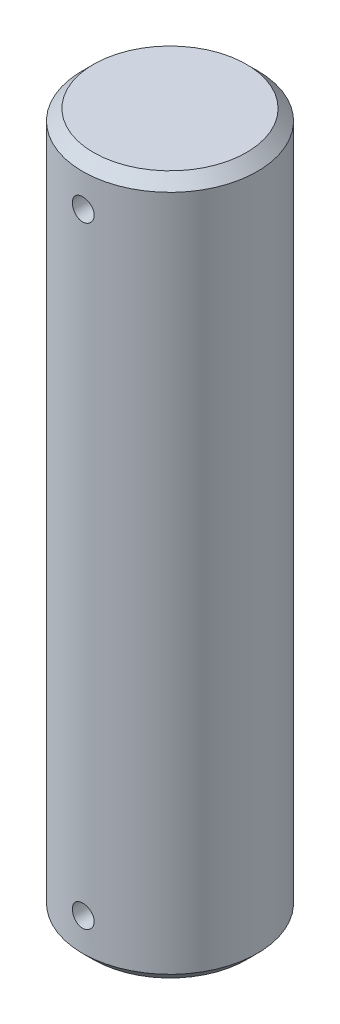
from build123d import *

# Parameters (mm, degrees)
SKETCH1_R           = 25.4
BOSS_EXTRUDE1_DEPTH = 101.6
SKETCH2_R           = 3.175
CUT_EXTRUDE2_DEPTH  = 31.75
CHAMFER1_SIZE       = 3.175


with BuildPart() as part:
    # Sketch1 → Boss-Extrude1 (new, symmetric)
    with BuildSketch(Plane(origin=(0, 0, 0), x_dir=(1, 0, 0), z_dir=(0, 1, 0))):
        with Locations(Location((0, 0, 0), (0, 0, 270))):
            Circle(SKETCH1_R)
    extrude(amount=BOSS_EXTRUDE1_DEPTH, both=True)

    # Sketch2 → Cut-Extrude2 (cut, symmetric)
    with BuildSketch(Plane.XY):
        with Locations((0, 88.9)):
            Circle(SKETCH2_R)
        with Locations((0, -88.9)):
            Circle(SKETCH2_R)
    extrude(amount=CUT_EXTRUDE2_DEPTH, both=True, mode=Mode.SUBTRACT)

    # Chamfer1
    chamfer1_edges = [part.edges().sort_by_distance(p)[0] for p in [
        (0, -101.6, -25.4),
        (0, 101.6, -25.4),
    ]]
    chamfer(chamfer1_edges, length=CHAMFER1_SIZE)


solid = part.part
